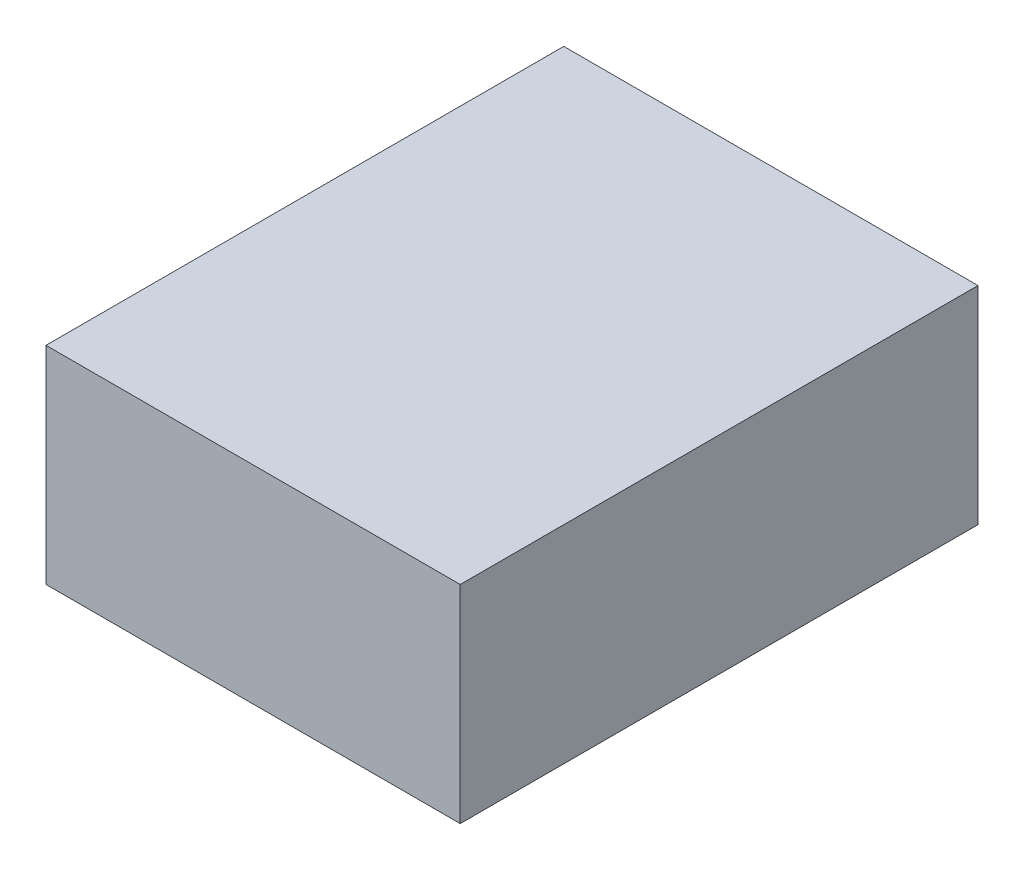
from build123d import *

# Parameters (mm, degrees)
SKETCH1_W      = 101.6
SKETCH1_H      = 50.8
EXTRUDE1_DEPTH = 63.5


with BuildPart() as part:
    # Sketch1 → Extrude1 (new, symmetric)
    with BuildSketch(Plane.XY):
        Rectangle(SKETCH1_W, SKETCH1_H)
    extrude(amount=EXTRUDE1_DEPTH, both=True)


solid = part.part
